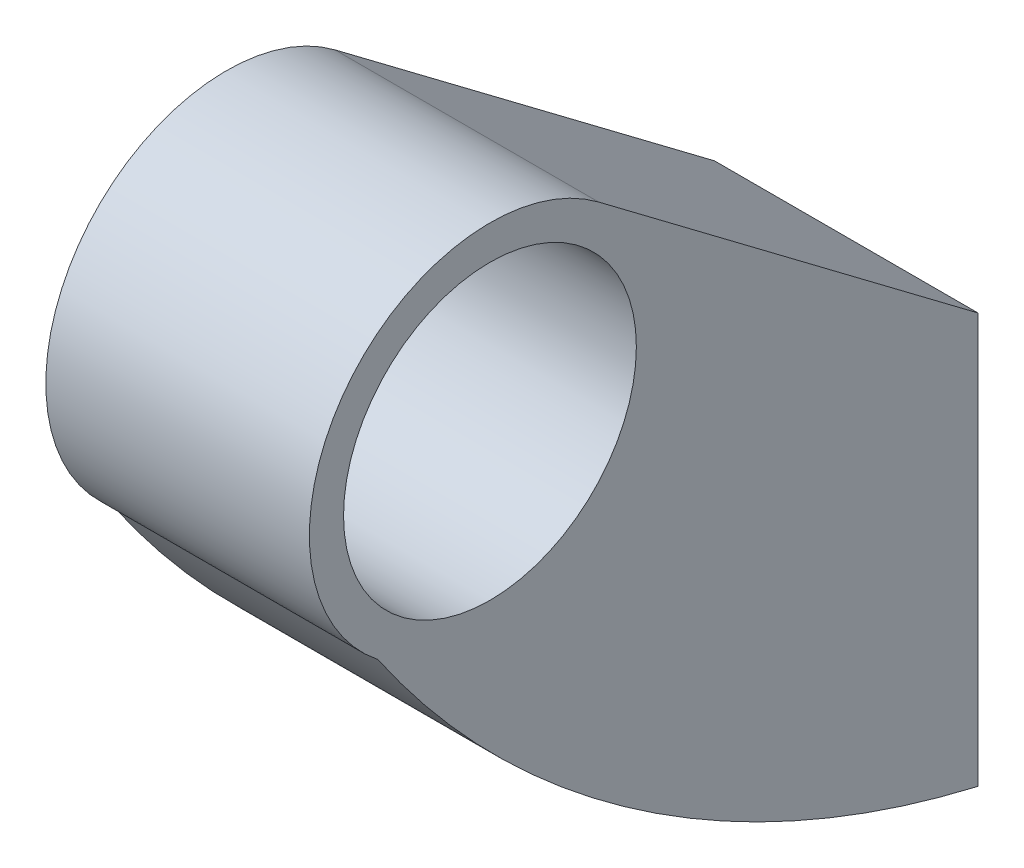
ISO-10303-21;
HEADER;
FILE_DESCRIPTION(('STEP AP214'),'2;1');
FILE_NAME('part.step','',(''),(''),'','','');
FILE_SCHEMA(('AUTOMOTIVE_DESIGN { 1 0 10303 214 1 1 1 1 }'));
ENDSEC;
DATA;
#1=APPLICATION_CONTEXT('core data for automotive mechanical design processes');
#2=APPLICATION_PROTOCOL_DEFINITION('international standard','automotive_design',2000,#1);
#3=PRODUCT_CONTEXT('',#1,'mechanical');
#4=PRODUCT('Part','Part','',(#3));
#5=PRODUCT_RELATED_PRODUCT_CATEGORY('part','',(#4));
#6=PRODUCT_DEFINITION_FORMATION('','',#4);
#7=PRODUCT_DEFINITION_CONTEXT('part definition',#1,'design');
#8=PRODUCT_DEFINITION('design','',#6,#7);
#9=PRODUCT_DEFINITION_SHAPE('','',#8);
#10=(LENGTH_UNIT() NAMED_UNIT(*) SI_UNIT(.MILLI.,.METRE.));
#11=(NAMED_UNIT(*) PLANE_ANGLE_UNIT() SI_UNIT($,.RADIAN.));
#12=(NAMED_UNIT(*) SI_UNIT($,.STERADIAN.) SOLID_ANGLE_UNIT());
#13=UNCERTAINTY_MEASURE_WITH_UNIT(LENGTH_MEASURE(1.E-05),#10,'distance_accuracy_value','');
#14=(GEOMETRIC_REPRESENTATION_CONTEXT(3) GLOBAL_UNCERTAINTY_ASSIGNED_CONTEXT((#13)) GLOBAL_UNIT_ASSIGNED_CONTEXT((#10,
#11,#12)) REPRESENTATION_CONTEXT('',''));
#15=CARTESIAN_POINT('',(0.,0.,0.));
#16=DIRECTION('',(0.,0.,1.));
#17=DIRECTION('',(1.,0.,0.));
#18=AXIS2_PLACEMENT_3D('',#15,#16,#17);
#19=CARTESIAN_POINT('',(-13.5,81.0801034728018,-23.2709129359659));
#20=DIRECTION('',(1.,0.,0.));
#21=DIRECTION('',(0.,1.,0.));
#22=AXIS2_PLACEMENT_3D('',#19,#20,#21);
#23=CYLINDRICAL_SURFACE('',#22,102.75);
#24=CARTESIAN_POINT('',(13.5,81.0801034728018,-23.2709129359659));
#25=DIRECTION('',(1.,0.,0.));
#26=DIRECTION('',(0.,1.,0.));
#27=AXIS2_PLACEMENT_3D('',#24,#25,#26);
#28=CIRCLE('',#27,102.75);
#29=CARTESIAN_POINT('',(13.5,23.,61.4891252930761));
#30=VERTEX_POINT('',#29);
#31=CARTESIAN_POINT('',(13.5,-19.,0.));
#32=VERTEX_POINT('',#31);
#33=EDGE_CURVE('E77',#30,#32,#28,.T.);
#34=ORIENTED_EDGE('',*,*,#33,.F.);
#35=DIRECTION('',(1.,0.,0.));
#36=VECTOR('',#35,1.);
#37=CARTESIAN_POINT('',(-13.5,23.,61.4891252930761));
#38=LINE('',#37,#36);
#39=CARTESIAN_POINT('',(-13.5,23.,61.4891252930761));
#40=VERTEX_POINT('',#39);
#41=EDGE_CURVE('E30',#40,#30,#38,.T.);
#42=ORIENTED_EDGE('',*,*,#41,.F.);
#43=CARTESIAN_POINT('',(-13.5,81.0801034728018,-23.2709129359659));
#44=DIRECTION('',(1.,0.,0.));
#45=DIRECTION('',(0.,1.,0.));
#46=AXIS2_PLACEMENT_3D('',#43,#44,#45);
#47=CIRCLE('',#46,102.75);
#48=CARTESIAN_POINT('',(-13.5,-19.,0.));
#49=VERTEX_POINT('',#48);
#50=EDGE_CURVE('E69',#40,#49,#47,.T.);
#51=ORIENTED_EDGE('',*,*,#50,.T.);
#52=DIRECTION('',(1.,0.,0.));
#53=VECTOR('',#52,1.);
#54=CARTESIAN_POINT('',(-13.5,-19.,0.));
#55=LINE('',#54,#53);
#56=EDGE_CURVE('E9',#49,#32,#55,.T.);
#57=ORIENTED_EDGE('',*,*,#56,.T.);
#58=EDGE_LOOP('',(#34,#42,#51,#57));
#59=FACE_BOUND('',#58,.T.);
#60=ADVANCED_FACE('F14',(#59),#23,.T.);
#61=CARTESIAN_POINT('',(-13.5,-19.,0.));
#62=DIRECTION('',(0.,0.,-1.));
#63=DIRECTION('',(0.,1.,0.));
#64=AXIS2_PLACEMENT_3D('',#61,#62,#63);
#65=PLANE('',#64);
#66=CARTESIAN_POINT('',(0.,0.,0.));
#67=DIRECTION('',(0.,0.,-1.));
#68=DIRECTION('',(0.,1.,0.));
#69=AXIS2_PLACEMENT_3D('',#66,#67,#68);
#70=CIRCLE('',#69,4.25);
#71=CARTESIAN_POINT('',(0.,4.25,0.));
#72=VERTEX_POINT('',#71);
#73=EDGE_CURVE('E81',#72,#72,#70,.T.);
#74=ORIENTED_EDGE('',*,*,#73,.F.);
#75=EDGE_LOOP('',(#74));
#76=FACE_BOUND('',#75,.T.);
#77=DIRECTION('',(0.,1.,0.));
#78=VECTOR('',#77,1.);
#79=CARTESIAN_POINT('',(13.5,-19.,0.));
#80=LINE('',#79,#78);
#81=CARTESIAN_POINT('',(13.5,23.,0.));
#82=VERTEX_POINT('',#81);
#83=EDGE_CURVE('E80',#32,#82,#80,.T.);
#84=ORIENTED_EDGE('',*,*,#83,.F.);
#85=ORIENTED_EDGE('',*,*,#56,.F.);
#86=DIRECTION('',(0.,1.,0.));
#87=VECTOR('',#86,1.);
#88=CARTESIAN_POINT('',(-13.5,-19.,0.));
#89=LINE('',#88,#87);
#90=CARTESIAN_POINT('',(-13.5,23.,0.));
#91=VERTEX_POINT('',#90);
#92=EDGE_CURVE('E65',#49,#91,#89,.T.);
#93=ORIENTED_EDGE('',*,*,#92,.T.);
#94=DIRECTION('',(1.,0.,0.));
#95=VECTOR('',#94,1.);
#96=CARTESIAN_POINT('',(-13.5,23.,0.));
#97=LINE('',#96,#95);
#98=EDGE_CURVE('E22',#91,#82,#97,.T.);
#99=ORIENTED_EDGE('',*,*,#98,.T.);
#100=EDGE_LOOP('',(#84,#85,#93,#99));
#101=FACE_BOUND('',#100,.T.);
#102=ADVANCED_FACE('F66',(#76,#101),#65,.T.);
#103=CARTESIAN_POINT('',(-13.5,23.,0.));
#104=DIRECTION('',(0.,0.798765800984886,-0.601642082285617));
#105=DIRECTION('',(0.,0.601642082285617,0.798765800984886));
#106=AXIS2_PLACEMENT_3D('',#103,#104,#105);
#107=PLANE('',#106);
#108=DIRECTION('',(0.,0.601642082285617,0.798765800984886));
#109=VECTOR('',#108,1.);
#110=CARTESIAN_POINT('',(13.5,23.,0.));
#111=LINE('',#110,#109);
#112=CARTESIAN_POINT('',(13.5,52.2771673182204,38.8696214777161));
#113=VERTEX_POINT('',#112);
#114=EDGE_CURVE('E63',#82,#113,#111,.T.);
#115=ORIENTED_EDGE('',*,*,#114,.F.);
#116=ORIENTED_EDGE('',*,*,#98,.F.);
#117=DIRECTION('',(0.,0.601642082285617,0.798765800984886));
#118=VECTOR('',#117,1.);
#119=CARTESIAN_POINT('',(-13.5,23.,0.));
#120=LINE('',#119,#118);
#121=CARTESIAN_POINT('',(-13.5,52.2771673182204,38.8696214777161));
#122=VERTEX_POINT('',#121);
#123=EDGE_CURVE('E60',#91,#122,#120,.T.);
#124=ORIENTED_EDGE('',*,*,#123,.T.);
#125=DIRECTION('',(1.,0.,0.));
#126=VECTOR('',#125,1.);
#127=CARTESIAN_POINT('',(-13.5,52.2771673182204,38.8696214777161));
#128=LINE('',#127,#126);
#129=EDGE_CURVE('E46',#122,#113,#128,.T.);
#130=ORIENTED_EDGE('',*,*,#129,.T.);
#131=EDGE_LOOP('',(#115,#116,#124,#130));
#132=FACE_BOUND('',#131,.T.);
#133=ADVANCED_FACE('F58',(#132),#107,.T.);
#134=CARTESIAN_POINT('',(-13.5,37.5,50.));
#135=DIRECTION('',(1.,0.,0.));
#136=DIRECTION('',(0.,1.,0.));
#137=AXIS2_PLACEMENT_3D('',#134,#135,#136);
#138=CYLINDRICAL_SURFACE('',#137,18.5);
#139=CARTESIAN_POINT('',(13.5,37.5,50.));
#140=DIRECTION('',(1.,0.,0.));
#141=DIRECTION('',(0.,1.,0.));
#142=AXIS2_PLACEMENT_3D('',#139,#140,#141);
#143=CIRCLE('',#142,18.5);
#144=EDGE_CURVE('E84',#113,#30,#143,.T.);
#145=ORIENTED_EDGE('',*,*,#144,.F.);
#146=ORIENTED_EDGE('',*,*,#129,.F.);
#147=CARTESIAN_POINT('',(-13.5,37.5,50.));
#148=DIRECTION('',(1.,0.,0.));
#149=DIRECTION('',(0.,1.,0.));
#150=AXIS2_PLACEMENT_3D('',#147,#148,#149);
#151=CIRCLE('',#150,18.5);
#152=EDGE_CURVE('E72',#122,#40,#151,.T.);
#153=ORIENTED_EDGE('',*,*,#152,.T.);
#154=ORIENTED_EDGE('',*,*,#41,.T.);
#155=EDGE_LOOP('',(#145,#146,#153,#154));
#156=FACE_BOUND('',#155,.T.);
#157=ADVANCED_FACE('F144',(#156),#138,.T.);
#158=CARTESIAN_POINT('',(-13.5,81.0801034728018,-23.2709129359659));
#159=DIRECTION('',(1.,0.,0.));
#160=DIRECTION('',(0.,1.,0.));
#161=AXIS2_PLACEMENT_3D('',#158,#159,#160);
#162=PLANE('',#161);
#163=CARTESIAN_POINT('',(-13.5,37.5,50.));
#164=DIRECTION('',(1.,0.,0.));
#165=DIRECTION('',(0.,0.,-1.));
#166=AXIS2_PLACEMENT_3D('',#163,#164,#165);
#167=CIRCLE('',#166,15.);
#168=CARTESIAN_POINT('',(-13.5,37.5,35.));
#169=VERTEX_POINT('',#168);
#170=EDGE_CURVE('E91',#169,#169,#167,.T.);
#171=ORIENTED_EDGE('',*,*,#170,.T.);
#172=EDGE_LOOP('',(#171));
#173=FACE_BOUND('',#172,.T.);
#174=ORIENTED_EDGE('',*,*,#50,.F.);
#175=ORIENTED_EDGE('',*,*,#152,.F.);
#176=ORIENTED_EDGE('',*,*,#123,.F.);
#177=ORIENTED_EDGE('',*,*,#92,.F.);
#178=EDGE_LOOP('',(#174,#175,#176,#177));
#179=FACE_BOUND('',#178,.T.);
#180=ADVANCED_FACE('F71',(#173,#179),#162,.F.);
#181=CARTESIAN_POINT('',(13.5,81.0801034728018,-23.2709129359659));
#182=DIRECTION('',(1.,0.,0.));
#183=DIRECTION('',(0.,1.,0.));
#184=AXIS2_PLACEMENT_3D('',#181,#182,#183);
#185=PLANE('',#184);
#186=CARTESIAN_POINT('',(13.5,37.5,50.));
#187=DIRECTION('',(1.,0.,0.));
#188=DIRECTION('',(0.,0.,-1.));
#189=AXIS2_PLACEMENT_3D('',#186,#187,#188);
#190=CIRCLE('',#189,15.);
#191=CARTESIAN_POINT('',(13.5,37.5,35.));
#192=VERTEX_POINT('',#191);
#193=EDGE_CURVE('E94',#192,#192,#190,.T.);
#194=ORIENTED_EDGE('',*,*,#193,.F.);
#195=EDGE_LOOP('',(#194));
#196=FACE_BOUND('',#195,.T.);
#197=ORIENTED_EDGE('',*,*,#33,.T.);
#198=ORIENTED_EDGE('',*,*,#83,.T.);
#199=ORIENTED_EDGE('',*,*,#114,.T.);
#200=ORIENTED_EDGE('',*,*,#144,.T.);
#201=EDGE_LOOP('',(#197,#198,#199,#200));
#202=FACE_BOUND('',#201,.T.);
#203=ADVANCED_FACE('F132',(#196,#202),#185,.T.);
#204=CARTESIAN_POINT('',(0.,0.,0.));
#205=DIRECTION('',(0.,0.,-1.));
#206=DIRECTION('',(0.,1.,0.));
#207=AXIS2_PLACEMENT_3D('',#204,#205,#206);
#208=CYLINDRICAL_SURFACE('',#207,4.25);
#209=ORIENTED_EDGE('',*,*,#73,.T.);
#210=EDGE_LOOP('',(#209));
#211=FACE_BOUND('',#210,.T.);
#212=CARTESIAN_POINT('',(0.,0.,17.5));
#213=DIRECTION('',(0.,0.,-1.));
#214=DIRECTION('',(-1.,0.,0.));
#215=AXIS2_PLACEMENT_3D('',#212,#213,#214);
#216=CIRCLE('',#215,4.25);
#217=CARTESIAN_POINT('',(-4.25,0.,17.5));
#218=VERTEX_POINT('',#217);
#219=EDGE_CURVE('E97',#218,#218,#216,.T.);
#220=ORIENTED_EDGE('',*,*,#219,.F.);
#221=EDGE_LOOP('',(#220));
#222=FACE_BOUND('',#221,.T.);
#223=ADVANCED_FACE('F134',(#211,#222),#208,.F.);
#224=CARTESIAN_POINT('',(-37.,37.5,50.));
#225=DIRECTION('',(1.,0.,0.));
#226=DIRECTION('',(0.,0.,-1.));
#227=AXIS2_PLACEMENT_3D('',#224,#225,#226);
#228=CYLINDRICAL_SURFACE('',#227,15.);
#229=ORIENTED_EDGE('',*,*,#193,.T.);
#230=EDGE_LOOP('',(#229));
#231=FACE_BOUND('',#230,.T.);
#232=ORIENTED_EDGE('',*,*,#170,.F.);
#233=EDGE_LOOP('',(#232));
#234=FACE_BOUND('',#233,.T.);
#235=ADVANCED_FACE('F112',(#231,#234),#228,.F.);
#236=CARTESIAN_POINT('',(0.,0.,27.5));
#237=DIRECTION('',(0.,0.,-1.));
#238=DIRECTION('',(-1.,0.,0.));
#239=AXIS2_PLACEMENT_3D('',#236,#237,#238);
#240=CYLINDRICAL_SURFACE('',#239,7.);
#241=CARTESIAN_POINT('',(0.,0.,27.5));
#242=DIRECTION('',(0.,0.,-1.));
#243=DIRECTION('',(-1.,0.,0.));
#244=AXIS2_PLACEMENT_3D('',#241,#242,#243);
#245=CIRCLE('',#244,7.);
#246=CARTESIAN_POINT('',(-7.,0.,27.5));
#247=VERTEX_POINT('',#246);
#248=EDGE_CURVE('E100',#247,#247,#245,.T.);
#249=ORIENTED_EDGE('',*,*,#248,.F.);
#250=EDGE_LOOP('',(#249));
#251=FACE_BOUND('',#250,.T.);
#252=CARTESIAN_POINT('',(0.,0.,17.5));
#253=DIRECTION('',(0.,0.,-1.));
#254=DIRECTION('',(-1.,0.,0.));
#255=AXIS2_PLACEMENT_3D('',#252,#253,#254);
#256=CIRCLE('',#255,7.);
#257=CARTESIAN_POINT('',(-7.,0.,17.5));
#258=VERTEX_POINT('',#257);
#259=EDGE_CURVE('E101',#258,#258,#256,.T.);
#260=ORIENTED_EDGE('',*,*,#259,.T.);
#261=EDGE_LOOP('',(#260));
#262=FACE_BOUND('',#261,.T.);
#263=ADVANCED_FACE('F109',(#251,#262),#240,.F.);
#264=CARTESIAN_POINT('',(0.,0.,27.5));
#265=DIRECTION('',(0.,0.,-1.));
#266=DIRECTION('',(-1.,0.,0.));
#267=AXIS2_PLACEMENT_3D('',#264,#265,#266);
#268=PLANE('',#267);
#269=ORIENTED_EDGE('',*,*,#248,.T.);
#270=EDGE_LOOP('',(#269));
#271=FACE_BOUND('',#270,.T.);
#272=ADVANCED_FACE('F107',(#271),#268,.T.);
#273=CARTESIAN_POINT('',(0.,0.,17.5));
#274=DIRECTION('',(0.,0.,-1.));
#275=DIRECTION('',(-1.,0.,0.));
#276=AXIS2_PLACEMENT_3D('',#273,#274,#275);
#277=PLANE('',#276);
#278=ORIENTED_EDGE('',*,*,#219,.T.);
#279=EDGE_LOOP('',(#278));
#280=FACE_BOUND('',#279,.T.);
#281=ORIENTED_EDGE('',*,*,#259,.F.);
#282=EDGE_LOOP('',(#281));
#283=FACE_BOUND('',#282,.T.);
#284=ADVANCED_FACE('F116',(#280,#283),#277,.F.);
#285=CLOSED_SHELL('',(#60,#102,#133,#157,#180,#203,#223,#235,#263,#272,#284));
#286=MANIFOLD_SOLID_BREP('B1',#285);
#287=ADVANCED_BREP_SHAPE_REPRESENTATION('',(#18,#286),#14);
#288=SHAPE_DEFINITION_REPRESENTATION(#9,#287);
ENDSEC;
END-ISO-10303-21;
